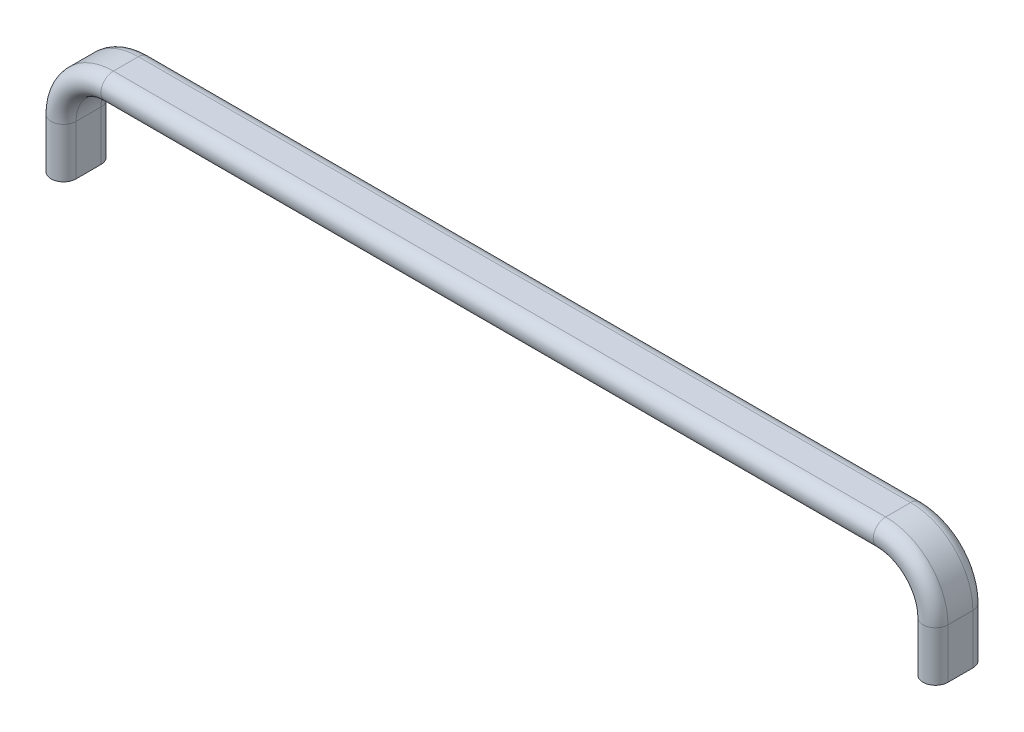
from build123d import *

# Parameters (mm, degrees)
SKETCH3_R      = 2.1
EXTRUDE1_DEPTH = 12.5
SKETCH4_R      = 2.5
EXTRUDE2_DEPTH = 10


with BuildPart() as part:
    # Sweep1: sweep along a path in Sketch1
    with BuildLine(Plane.XY) as sweep1_path:
        Line((-175, 0), (-175, 20))
        ThreePointArc((-175, 20), (-169.142135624, 34.142135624), (-155, 40))
        Line((-155, 40), (155, 40))
        ThreePointArc((155, 40), (169.142135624, 34.142135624), (175, 20))
        Line((175, 20), (175, 0))
    # Sketch2 → Sweep1 (sweep)
    with BuildSketch(Plane(origin=(0, 0, 0), x_dir=(1, 0, 0), z_dir=(0, 1, 0))):
        with BuildLine():
            Line((-180, -5), (-180, 5))
            ThreePointArc((-180, 5), (-175, 10), (-170, 5))
            Line((-170, 5), (-170, -5))
            ThreePointArc((-170, -5), (-175, -10), (-180, -5))
        make_face()
    sweep(path=sweep1_path.line)

    # Sketch3 → Extrude1 (cut)
    with BuildSketch(Plane.XZ):
        with Locations(Location((-175, 0, 0), (0, 0, 270))):
            Circle(SKETCH3_R)
    extrude1 = extrude(amount=-EXTRUDE1_DEPTH, mode=Mode.SUBTRACT)

    # Sketch4 → Extrude2 (cut)
    with BuildSketch(Plane.XZ):
        with Locations(Location((-175, 0, 0), (0, 0, 270))):
            Circle(SKETCH4_R)
    extrude2 = extrude(amount=-EXTRUDE2_DEPTH, mode=Mode.SUBTRACT)

    # Sketch5 → Cut-Revolve1 (revolve, cut)
    with BuildSketch(Plane.XY, mode=Mode.PRIVATE) as cut_revolve1_sk:
        Polygon((-175, 12.5), (-177.1, 12.5), (-175, 13.712435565), align=None)
    cut_revolve1 = revolve(cut_revolve1_sk.sketch.rotate(Axis((-175, 13.712435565, 0), (0, -1, 0)), 90), axis=Axis((-175, 13.712435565, 0), (0, -1, 0)), mode=Mode.SUBTRACT)

    # Mirror1: Extrude1, Extrude2, Cut-Revolve1 across plane
    add(extrude1.mirror(Plane(origin=(0, 0, 0), x_dir=(0, 0, 1), z_dir=(1, 0, 0))), mode=Mode.SUBTRACT)
    add(extrude2.mirror(Plane(origin=(0, 0, 0), x_dir=(0, 0, 1), z_dir=(1, 0, 0))), mode=Mode.SUBTRACT)
    add(cut_revolve1.mirror(Plane(origin=(0, 0, 0), x_dir=(0, 0, 1), z_dir=(1, 0, 0))), mode=Mode.SUBTRACT)


solid = part.part
